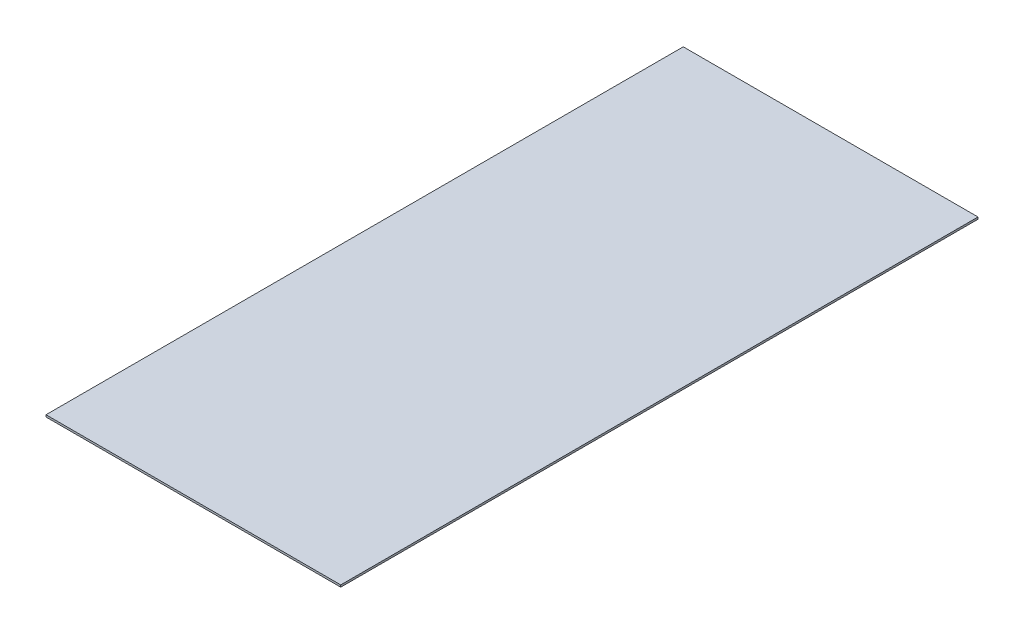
ISO-10303-21;
HEADER;
FILE_DESCRIPTION(('STEP AP214'),'2;1');
FILE_NAME('part.step','',(''),(''),'','','');
FILE_SCHEMA(('AUTOMOTIVE_DESIGN { 1 0 10303 214 1 1 1 1 }'));
ENDSEC;
DATA;
#1=APPLICATION_CONTEXT('core data for automotive mechanical design processes');
#2=APPLICATION_PROTOCOL_DEFINITION('international standard','automotive_design',2000,#1);
#3=PRODUCT_CONTEXT('',#1,'mechanical');
#4=PRODUCT('Part','Part','',(#3));
#5=PRODUCT_RELATED_PRODUCT_CATEGORY('part','',(#4));
#6=PRODUCT_DEFINITION_FORMATION('','',#4);
#7=PRODUCT_DEFINITION_CONTEXT('part definition',#1,'design');
#8=PRODUCT_DEFINITION('design','',#6,#7);
#9=PRODUCT_DEFINITION_SHAPE('','',#8);
#10=(LENGTH_UNIT() NAMED_UNIT(*) SI_UNIT(.MILLI.,.METRE.));
#11=(NAMED_UNIT(*) PLANE_ANGLE_UNIT() SI_UNIT($,.RADIAN.));
#12=(NAMED_UNIT(*) SI_UNIT($,.STERADIAN.) SOLID_ANGLE_UNIT());
#13=UNCERTAINTY_MEASURE_WITH_UNIT(LENGTH_MEASURE(1.E-05),#10,'distance_accuracy_value','');
#14=(GEOMETRIC_REPRESENTATION_CONTEXT(3) GLOBAL_UNCERTAINTY_ASSIGNED_CONTEXT((#13)) GLOBAL_UNIT_ASSIGNED_CONTEXT((#10,
#11,#12)) REPRESENTATION_CONTEXT('',''));
#15=CARTESIAN_POINT('',(0.,0.,0.));
#16=DIRECTION('',(0.,0.,1.));
#17=DIRECTION('',(1.,0.,0.));
#18=AXIS2_PLACEMENT_3D('',#15,#16,#17);
#19=CARTESIAN_POINT('',(352.425,4.7625,-762.));
#20=DIRECTION('',(-1.,0.,0.));
#21=DIRECTION('',(0.,0.,1.));
#22=AXIS2_PLACEMENT_3D('',#19,#20,#21);
#23=PLANE('',#22);
#24=DIRECTION('',(0.,0.,-1.));
#25=VECTOR('',#24,1.);
#26=CARTESIAN_POINT('',(352.425,0.,-762.));
#27=LINE('',#26,#25);
#28=CARTESIAN_POINT('',(352.425,0.,762.));
#29=VERTEX_POINT('',#28);
#30=CARTESIAN_POINT('',(352.425,0.,-762.));
#31=VERTEX_POINT('',#30);
#32=EDGE_CURVE('E100',#29,#31,#27,.T.);
#33=ORIENTED_EDGE('',*,*,#32,.T.);
#34=DIRECTION('',(0.,-1.,0.));
#35=VECTOR('',#34,1.);
#36=CARTESIAN_POINT('',(352.425,4.7625,-762.));
#37=LINE('',#36,#35);
#38=CARTESIAN_POINT('',(352.425,4.7625,-762.));
#39=VERTEX_POINT('',#38);
#40=EDGE_CURVE('E11',#39,#31,#37,.T.);
#41=ORIENTED_EDGE('',*,*,#40,.F.);
#42=DIRECTION('',(0.,0.,-1.));
#43=VECTOR('',#42,1.);
#44=CARTESIAN_POINT('',(352.425,4.7625,-762.));
#45=LINE('',#44,#43);
#46=CARTESIAN_POINT('',(352.425,4.7625,762.));
#47=VERTEX_POINT('',#46);
#48=EDGE_CURVE('E88',#47,#39,#45,.T.);
#49=ORIENTED_EDGE('',*,*,#48,.F.);
#50=DIRECTION('',(0.,-1.,0.));
#51=VECTOR('',#50,1.);
#52=CARTESIAN_POINT('',(352.425,4.7625,762.));
#53=LINE('',#52,#51);
#54=EDGE_CURVE('E96',#47,#29,#53,.T.);
#55=ORIENTED_EDGE('',*,*,#54,.T.);
#56=EDGE_LOOP('',(#33,#41,#49,#55));
#57=FACE_BOUND('',#56,.T.);
#58=ADVANCED_FACE('F37',(#57),#23,.F.);
#59=CARTESIAN_POINT('',(-352.425,4.7625,-762.));
#60=DIRECTION('',(0.,0.,1.));
#61=DIRECTION('',(1.,0.,0.));
#62=AXIS2_PLACEMENT_3D('',#59,#60,#61);
#63=PLANE('',#62);
#64=DIRECTION('',(-1.,0.,0.));
#65=VECTOR('',#64,1.);
#66=CARTESIAN_POINT('',(-352.425,0.,-762.));
#67=LINE('',#66,#65);
#68=CARTESIAN_POINT('',(-352.425,0.,-762.));
#69=VERTEX_POINT('',#68);
#70=EDGE_CURVE('E92',#31,#69,#67,.T.);
#71=ORIENTED_EDGE('',*,*,#70,.T.);
#72=DIRECTION('',(0.,-1.,0.));
#73=VECTOR('',#72,1.);
#74=CARTESIAN_POINT('',(-352.425,4.7625,-762.));
#75=LINE('',#74,#73);
#76=CARTESIAN_POINT('',(-352.425,4.7625,-762.));
#77=VERTEX_POINT('',#76);
#78=EDGE_CURVE('E45',#77,#69,#75,.T.);
#79=ORIENTED_EDGE('',*,*,#78,.F.);
#80=DIRECTION('',(-1.,0.,0.));
#81=VECTOR('',#80,1.);
#82=CARTESIAN_POINT('',(-352.425,4.7625,-762.));
#83=LINE('',#82,#81);
#84=EDGE_CURVE('E83',#39,#77,#83,.T.);
#85=ORIENTED_EDGE('',*,*,#84,.F.);
#86=ORIENTED_EDGE('',*,*,#40,.T.);
#87=EDGE_LOOP('',(#71,#79,#85,#86));
#88=FACE_BOUND('',#87,.T.);
#89=ADVANCED_FACE('F91',(#88),#63,.F.);
#90=CARTESIAN_POINT('',(-352.425,4.7625,-762.));
#91=DIRECTION('',(1.,0.,0.));
#92=DIRECTION('',(0.,0.,-1.));
#93=AXIS2_PLACEMENT_3D('',#90,#91,#92);
#94=PLANE('',#93);
#95=DIRECTION('',(0.,0.,1.));
#96=VECTOR('',#95,1.);
#97=CARTESIAN_POINT('',(-352.425,0.,-762.));
#98=LINE('',#97,#96);
#99=CARTESIAN_POINT('',(-352.425,0.,762.));
#100=VERTEX_POINT('',#99);
#101=EDGE_CURVE('E70',#69,#100,#98,.T.);
#102=ORIENTED_EDGE('',*,*,#101,.T.);
#103=DIRECTION('',(0.,-1.,0.));
#104=VECTOR('',#103,1.);
#105=CARTESIAN_POINT('',(-352.425,4.7625,762.));
#106=LINE('',#105,#104);
#107=CARTESIAN_POINT('',(-352.425,4.7625,762.));
#108=VERTEX_POINT('',#107);
#109=EDGE_CURVE('E93',#108,#100,#106,.T.);
#110=ORIENTED_EDGE('',*,*,#109,.F.);
#111=DIRECTION('',(0.,0.,1.));
#112=VECTOR('',#111,1.);
#113=CARTESIAN_POINT('',(-352.425,4.7625,-762.));
#114=LINE('',#113,#112);
#115=EDGE_CURVE('E86',#77,#108,#114,.T.);
#116=ORIENTED_EDGE('',*,*,#115,.F.);
#117=ORIENTED_EDGE('',*,*,#78,.T.);
#118=EDGE_LOOP('',(#102,#110,#116,#117));
#119=FACE_BOUND('',#118,.T.);
#120=ADVANCED_FACE('F94',(#119),#94,.F.);
#121=CARTESIAN_POINT('',(-352.425,4.7625,762.));
#122=DIRECTION('',(0.,0.,-1.));
#123=DIRECTION('',(-1.,0.,0.));
#124=AXIS2_PLACEMENT_3D('',#121,#122,#123);
#125=PLANE('',#124);
#126=DIRECTION('',(1.,0.,0.));
#127=VECTOR('',#126,1.);
#128=CARTESIAN_POINT('',(-352.425,0.,762.));
#129=LINE('',#128,#127);
#130=EDGE_CURVE('E76',#100,#29,#129,.T.);
#131=ORIENTED_EDGE('',*,*,#130,.T.);
#132=ORIENTED_EDGE('',*,*,#54,.F.);
#133=DIRECTION('',(1.,0.,0.));
#134=VECTOR('',#133,1.);
#135=CARTESIAN_POINT('',(-352.425,4.7625,762.));
#136=LINE('',#135,#134);
#137=EDGE_CURVE('E53',#108,#47,#136,.T.);
#138=ORIENTED_EDGE('',*,*,#137,.F.);
#139=ORIENTED_EDGE('',*,*,#109,.T.);
#140=EDGE_LOOP('',(#131,#132,#138,#139));
#141=FACE_BOUND('',#140,.T.);
#142=ADVANCED_FACE('F107',(#141),#125,.F.);
#143=CARTESIAN_POINT('',(352.425,4.7625,762.));
#144=DIRECTION('',(0.,1.,0.));
#145=DIRECTION('',(0.,0.,1.));
#146=AXIS2_PLACEMENT_3D('',#143,#144,#145);
#147=PLANE('',#146);
#148=ORIENTED_EDGE('',*,*,#48,.T.);
#149=ORIENTED_EDGE('',*,*,#84,.T.);
#150=ORIENTED_EDGE('',*,*,#115,.T.);
#151=ORIENTED_EDGE('',*,*,#137,.T.);
#152=EDGE_LOOP('',(#148,#149,#150,#151));
#153=FACE_BOUND('',#152,.T.);
#154=ADVANCED_FACE('F84',(#153),#147,.T.);
#155=CARTESIAN_POINT('',(352.425,0.,762.));
#156=DIRECTION('',(0.,1.,0.));
#157=DIRECTION('',(0.,0.,1.));
#158=AXIS2_PLACEMENT_3D('',#155,#156,#157);
#159=PLANE('',#158);
#160=ORIENTED_EDGE('',*,*,#32,.F.);
#161=ORIENTED_EDGE('',*,*,#130,.F.);
#162=ORIENTED_EDGE('',*,*,#101,.F.);
#163=ORIENTED_EDGE('',*,*,#70,.F.);
#164=EDGE_LOOP('',(#160,#161,#162,#163));
#165=FACE_BOUND('',#164,.T.);
#166=ADVANCED_FACE('F110',(#165),#159,.F.);
#167=CLOSED_SHELL('',(#58,#89,#120,#142,#154,#166));
#168=MANIFOLD_SOLID_BREP('B2',#167);
#169=ADVANCED_BREP_SHAPE_REPRESENTATION('',(#18,#168),#14);
#170=SHAPE_DEFINITION_REPRESENTATION(#9,#169);
ENDSEC;
END-ISO-10303-21;
